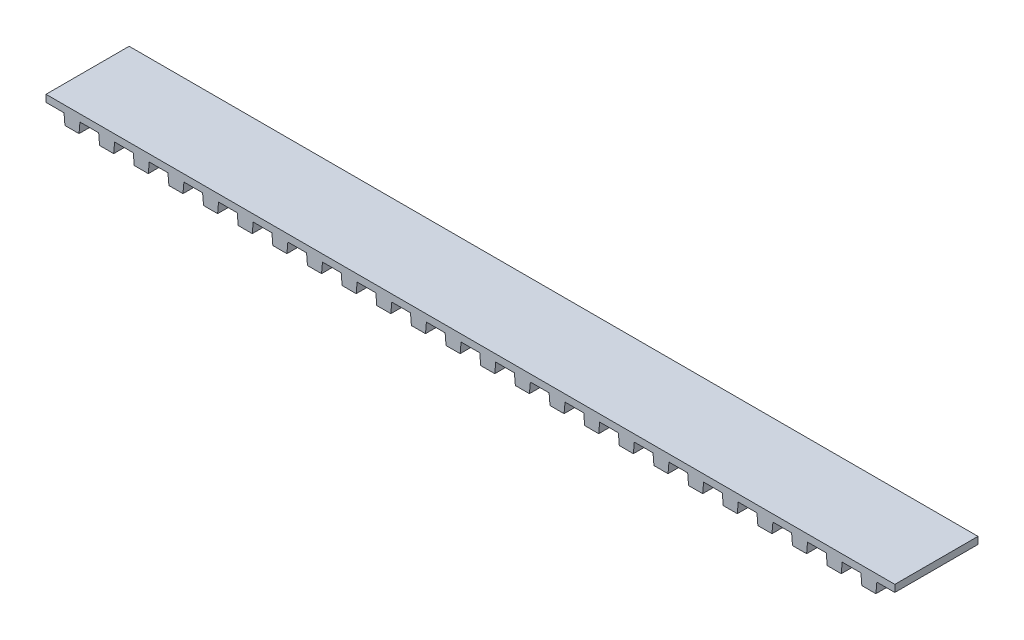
from build123d import *

# Parameters (mm, degrees)
SKETCH1_W       = 30.625
SKETCH1_H       = 0.508
EXTRUDE1_DEPTH  = 6
EXTRUDE2_DEPTH  = 6
LPATTERN1_COUNT = 12
LPATTERN1_PITCH = 2.5


with BuildPart() as part:
    # Sketch1 → Extrude1 (new body)
    with BuildSketch(Plane.XY):
        with Locations((15.3125, 1.016)):
            Rectangle(SKETCH1_W, SKETCH1_H)
    extrude(amount=EXTRUDE1_DEPTH)

    # Sketch2 → Extrude2 (add)
    with BuildSketch(Plane.XY):
        Polygon((0.675333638, 0.762), (0.742, 0), (1.758, 0), (1.824666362, 0.762), align=None)
    extrude2 = extrude(amount=EXTRUDE2_DEPTH)

    # LPattern1: Extrude2 ×12
    with Locations(*[(i * LPATTERN1_PITCH, 0, 0) for i in range(1, LPATTERN1_COUNT)]):
        add(extrude2)

    # Mirror1: part across plane


with BuildPart() as part_1:
    add(part.part)
    add(part.part.mirror(Plane(origin=(0, 0, 0), x_dir=(0, 0, 1), z_dir=(1, 0, 0))))


solid = part_1.part
